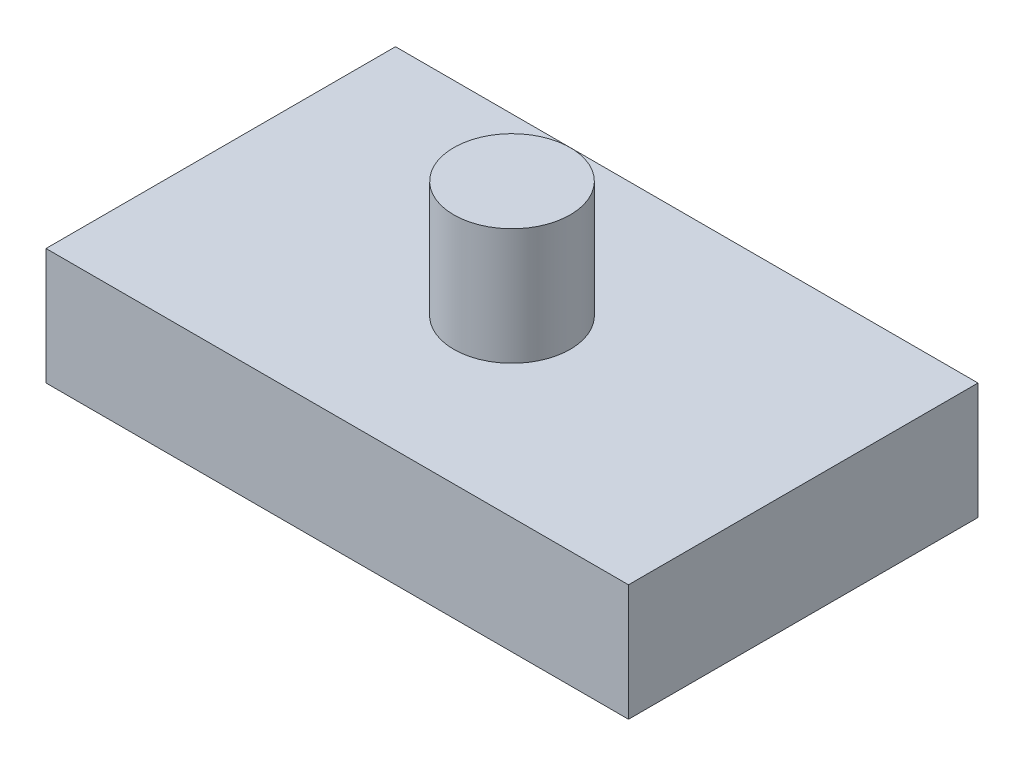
from build123d import *

# Parameters (mm, degrees)
SKETCH_1_W      = 50
SKETCH_1_H      = 30
EXTRUDE_1_DEPTH = 10
SKETCH_2_R      = 5
EXTRUDE_2_DEPTH = 10


with BuildPart() as part:
    # Sketch 1 → Extrude 1 (new body)
    with BuildSketch(Plane(origin=(0, 0, 0), x_dir=(1, 0, 0), z_dir=(0, 1, 0))):
        Rectangle(SKETCH_1_W, SKETCH_1_H)
    extrude(amount=EXTRUDE_1_DEPTH)

    # Sketch 2 → Extrude 2 (add)
    with BuildSketch(Plane(origin=(0, 10, 0), x_dir=(1, 0, 0), z_dir=(0, 1, 0))):
        with Locations(Location((0, 0, 0), (0, 0, 270))):
            Circle(SKETCH_2_R)
    extrude(amount=EXTRUDE_2_DEPTH)


solid = part.part
